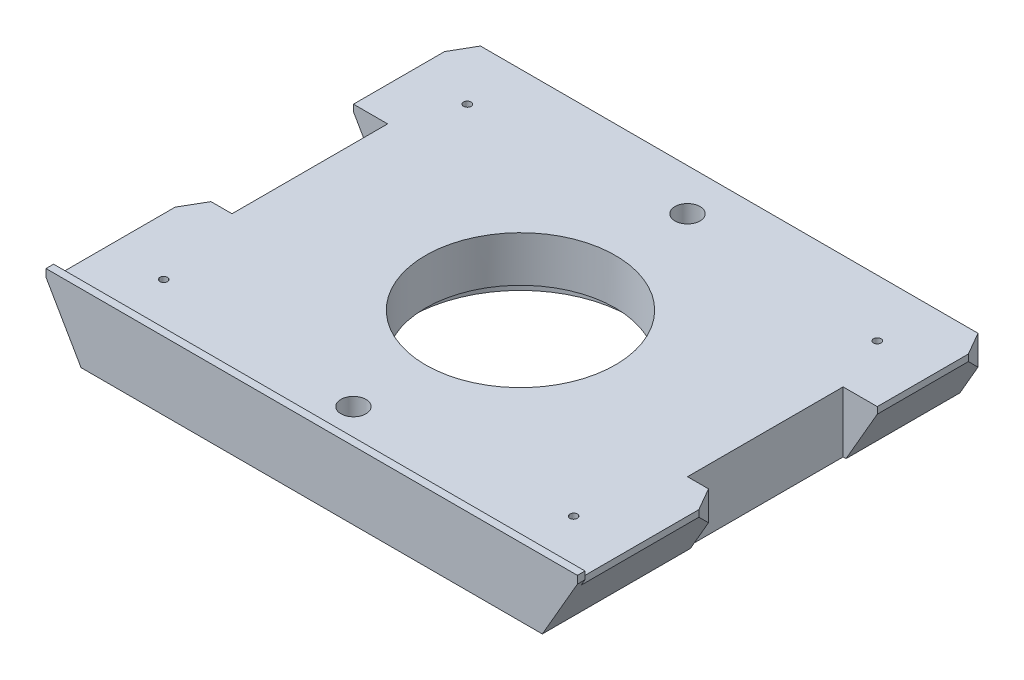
from build123d import *

# Parameters (mm, degrees)
SKETCH1_W                    = 55
SKETCH1_H                    = 8
BOSS_EXTRUDE1_DEPTH          = 35
CUT_EXTRUDE1_DEPTH           = 66.314623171
SKETCH20_W                   = 70
SKETCH20_H                   = 1
BOSS_EXTRUDE2_DEPTH          = 1
CUT_EXTRUDE4_DEPTH           = 54
F_1_0_1_DIAMETER_HOLE1_D     = 1
F_1_0_1_DIAMETER_HOLE1_DEPTH = 2
F_1_0_1_DIAMETER_HOLE1_TIP   = 0.30043031
SKETCH26_W                   = 4.5
SKETCH26_H                   = 20.5
CUT_EXTRUDE5_DEPTH           = 46.224440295
SKETCH27_R                   = 12.5
CUT_EXTRUDE6_DEPTH           = 46.224440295
SKETCH29_R                   = 14.5
CUT_EXTRUDE7_DEPTH           = 2
M4X0_7_TAPPED_HOLE1_D        = 3.3
CUT_EXTRUDE8_DEPTH           = 46.224440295


with BuildPart() as part:
    # Sketch1 → Boss-Extrude1 (new, symmetric)
    with BuildSketch(Plane(origin=(0, 0, 0), x_dir=(0, 0, -1), z_dir=(1, 0, 0))):
        Rectangle(SKETCH1_W, SKETCH1_H)
    extrude(amount=BOSS_EXTRUDE1_DEPTH, both=True)

    # Sketch2 → Cut-Extrude1 (cut, through all)
    with BuildSketch(Plane.XY.offset(27.5)):
        Polygon((-35, 4), (-30.381197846, -4), (-35, -4), align=None)
        Polygon((35, 4), (35, -4), (30.381197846, -4), align=None)
    extrude(amount=-CUT_EXTRUDE1_DEPTH, mode=Mode.SUBTRACT)

    # Sketch20 → Boss-Extrude2 (add)
    with BuildSketch(Plane(origin=(0, 4, 0), x_dir=(1, 0, 0), z_dir=(0, 1, 0))):
        with Locations((0, -27)):
            Rectangle(SKETCH20_W, SKETCH20_H)
    extrude(amount=BOSS_EXTRUDE2_DEPTH)

    # Sketch23 → Cut-Extrude4 (cut)
    with BuildSketch(Plane(origin=(0, 0, 26.5), x_dir=(-1, 0, 0), z_dir=(0, 0, -1))):
        Polygon((-35, 4), (-34.5, 4), (-34.5, 3.133974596), align=None)
        Polygon((35, 4), (34.5, 4), (34.5, 3.133974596), align=None)
    extrude(amount=CUT_EXTRUDE4_DEPTH, mode=Mode.SUBTRACT)

    # 1.0 _1_ Diameter Hole1
    with Locations(Plane(origin=(0, 4, 0), x_dir=(1, 0, 0), z_dir=(0, 1, 0))):
        with Locations((-27, 20), (27, 20), (27, -20), (-27, -20)):
            Hole(F_1_0_1_DIAMETER_HOLE1_D / 2, depth=F_1_0_1_DIAMETER_HOLE1_DEPTH)
            with Locations((0, 0, -(F_1_0_1_DIAMETER_HOLE1_DEPTH + F_1_0_1_DIAMETER_HOLE1_TIP / 2))):  # 118° drill point
                Cone(0, F_1_0_1_DIAMETER_HOLE1_D / 2, F_1_0_1_DIAMETER_HOLE1_TIP, mode=Mode.SUBTRACT)

    # Sketch26 → Cut-Extrude5 (cut, through all)
    with BuildSketch(Plane(origin=(0, 4, 0), x_dir=(1, 0, 0), z_dir=(0, 1, 0))):
        with Locations((-32.25, 2.25)):
            Rectangle(SKETCH26_W, SKETCH26_H)
        with Locations((32.25, 2.25)):
            Rectangle(SKETCH26_W, SKETCH26_H)
    extrude(amount=-CUT_EXTRUDE5_DEPTH, mode=Mode.SUBTRACT)

    # Sketch27 → Cut-Extrude6 (cut, through all)
    with BuildSketch(Plane(origin=(0, 4, 0), x_dir=(1, 0, 0), z_dir=(0, 1, 0))):
        with Locations(Location((0, 0, 0), (0, 0, 270))):
            Circle(SKETCH27_R)
    extrude(amount=-CUT_EXTRUDE6_DEPTH, mode=Mode.SUBTRACT)

    # Sketch29 → Cut-Extrude7 (cut)
    with BuildSketch(Plane(origin=(0, -4, 0), x_dir=(-1, 0, 0), z_dir=(0, -1, 0))):
        with Locations(Location((0, 0, 0), (0, 0, 90))):
            Circle(SKETCH29_R)
    extrude(amount=-CUT_EXTRUDE7_DEPTH, mode=Mode.SUBTRACT)

    # M4x0.7 Tapped Hole1 (through all)
    with Locations(Plane(origin=(0, 4, 0), x_dir=(1, 0, 0), z_dir=(0, 1, 0))):
        with Locations((0, 22), (0, -22)):
            Hole(M4X0_7_TAPPED_HOLE1_D / 2)

    # Sketch33 → Cut-Extrude8 (cut, through all)
    with BuildSketch(Plane(origin=(0, 4, 0), x_dir=(1, 0, 0), z_dir=(0, 1, 0))):
        Polygon((-34.5, 27.5), (-34.5, 24.5), (-32.767949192, 27.5), align=None)
        Polygon((-34.5, -8), (-32.767949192, -8), (-34.5, -11), align=None)
        Polygon((34.5, 27.5), (32.767949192, 27.5), (34.5, 24.5), align=None)
        Polygon((34.5, -8), (32.767949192, -8), (34.5, -11), align=None)
    extrude(amount=-CUT_EXTRUDE8_DEPTH, mode=Mode.SUBTRACT)


solid = part.part
